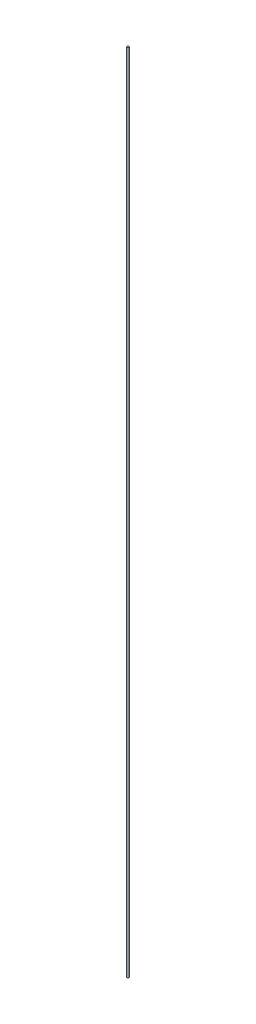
from build123d import *

# Parameters (mm, degrees)
CROQUIS2_R = 2


with BuildPart() as part:
    # Barrer1: sweep along a path in Croquis1
    with BuildLine(Plane(origin=(0, 0, 0), x_dir=(0, 0, -1), z_dir=(1, 0, 0))) as barrer1_path:
        Line((0, 0), (0, 1500))
    # Croquis2 → Barrer1 (sweep)
    with BuildSketch(Plane(origin=(0, 0, 0), x_dir=(1, 0, 0), z_dir=(0, 1, 0))):
        Circle(CROQUIS2_R)
    sweep(path=barrer1_path.line)


solid = part.part
